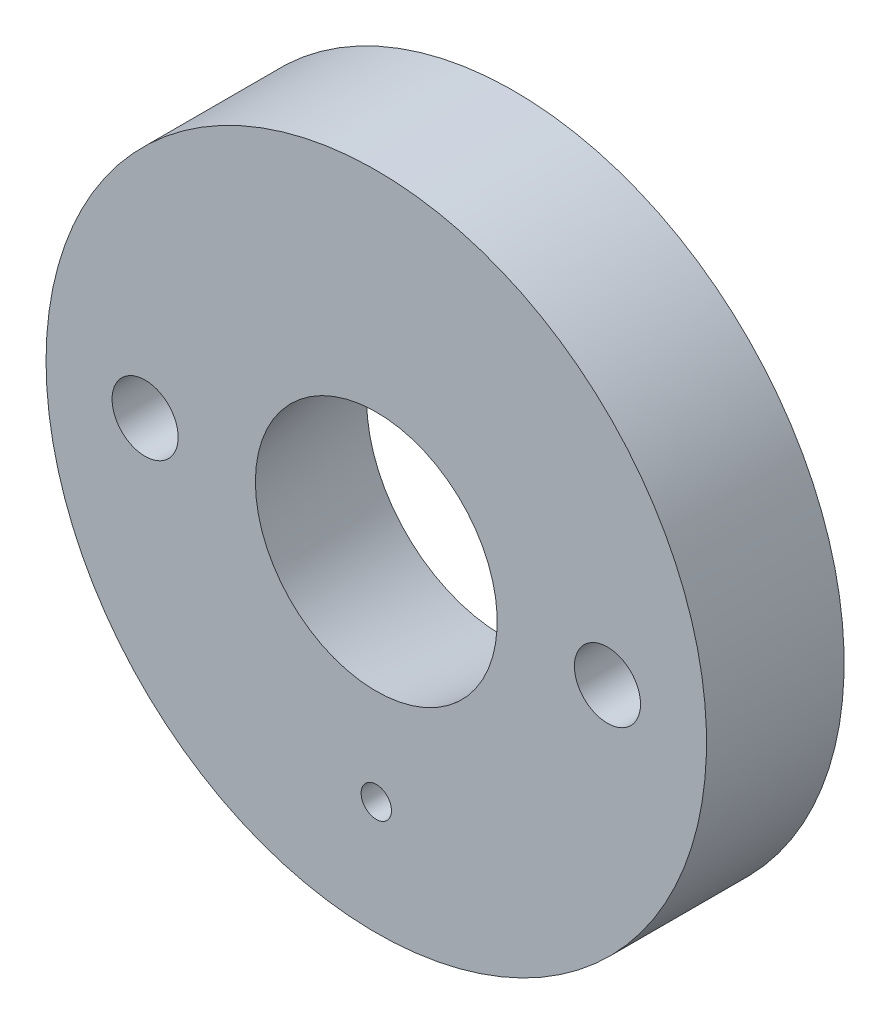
ISO-10303-21;
HEADER;
FILE_DESCRIPTION(('STEP AP214'),'2;1');
FILE_NAME('part.step','',(''),(''),'','','');
FILE_SCHEMA(('AUTOMOTIVE_DESIGN { 1 0 10303 214 1 1 1 1 }'));
ENDSEC;
DATA;
#1=APPLICATION_CONTEXT('core data for automotive mechanical design processes');
#2=APPLICATION_PROTOCOL_DEFINITION('international standard','automotive_design',2000,#1);
#3=PRODUCT_CONTEXT('',#1,'mechanical');
#4=PRODUCT('Part','Part','',(#3));
#5=PRODUCT_RELATED_PRODUCT_CATEGORY('part','',(#4));
#6=PRODUCT_DEFINITION_FORMATION('','',#4);
#7=PRODUCT_DEFINITION_CONTEXT('part definition',#1,'design');
#8=PRODUCT_DEFINITION('design','',#6,#7);
#9=PRODUCT_DEFINITION_SHAPE('','',#8);
#10=(LENGTH_UNIT() NAMED_UNIT(*) SI_UNIT(.MILLI.,.METRE.));
#11=(NAMED_UNIT(*) PLANE_ANGLE_UNIT() SI_UNIT($,.RADIAN.));
#12=(NAMED_UNIT(*) SI_UNIT($,.STERADIAN.) SOLID_ANGLE_UNIT());
#13=UNCERTAINTY_MEASURE_WITH_UNIT(LENGTH_MEASURE(1.E-05),#10,'distance_accuracy_value','');
#14=(GEOMETRIC_REPRESENTATION_CONTEXT(3) GLOBAL_UNCERTAINTY_ASSIGNED_CONTEXT((#13)) GLOBAL_UNIT_ASSIGNED_CONTEXT((#10,
#11,#12)) REPRESENTATION_CONTEXT('',''));
#15=CARTESIAN_POINT('',(0.,0.,0.));
#16=DIRECTION('',(0.,0.,1.));
#17=DIRECTION('',(1.,0.,0.));
#18=AXIS2_PLACEMENT_3D('',#15,#16,#17);
#19=CARTESIAN_POINT('',(0.,0.,0.));
#20=DIRECTION('',(0.,0.,-1.));
#21=DIRECTION('',(-1.,0.,0.));
#22=AXIS2_PLACEMENT_3D('',#19,#20,#21);
#23=CONICAL_SURFACE('',#22,5.58,0.120670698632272);
#24=CARTESIAN_POINT('',(0.,0.,0.));
#25=DIRECTION('',(0.,0.,-1.));
#26=DIRECTION('',(-1.,0.,0.));
#27=AXIS2_PLACEMENT_3D('',#24,#25,#26);
#28=CIRCLE('',#27,5.58);
#29=CARTESIAN_POINT('',(-5.58,0.,0.));
#30=VERTEX_POINT('',#29);
#31=EDGE_CURVE('E47',#30,#30,#28,.T.);
#32=ORIENTED_EDGE('',*,*,#31,.F.);
#33=EDGE_LOOP('',(#32));
#34=FACE_BOUND('',#33,.T.);
#35=CARTESIAN_POINT('',(0.,0.,-5.842));
#36=DIRECTION('',(0.,0.,-1.));
#37=DIRECTION('',(-1.,0.,0.));
#38=AXIS2_PLACEMENT_3D('',#35,#36,#37);
#39=CIRCLE('',#38,6.2884);
#40=CARTESIAN_POINT('',(-6.2884,0.,-5.842));
#41=VERTEX_POINT('',#40);
#42=EDGE_CURVE('E39',#41,#41,#39,.T.);
#43=ORIENTED_EDGE('',*,*,#42,.T.);
#44=EDGE_LOOP('',(#43));
#45=FACE_BOUND('',#44,.T.);
#46=ADVANCED_FACE('F35',(#34,#45),#23,.F.);
#47=CARTESIAN_POINT('',(-15.24,0.,0.));
#48=DIRECTION('',(0.,0.,1.));
#49=DIRECTION('',(1.,0.,0.));
#50=AXIS2_PLACEMENT_3D('',#47,#48,#49);
#51=PLANE('',#50);
#52=CARTESIAN_POINT('',(0.,-10.,0.));
#53=DIRECTION('',(0.,0.,1.));
#54=DIRECTION('',(1.,0.,0.));
#55=AXIS2_PLACEMENT_3D('',#52,#53,#54);
#56=CIRCLE('',#55,0.7);
#57=CARTESIAN_POINT('',(0.7,-10.,0.));
#58=VERTEX_POINT('',#57);
#59=EDGE_CURVE('E71',#58,#58,#56,.T.);
#60=ORIENTED_EDGE('',*,*,#59,.F.);
#61=EDGE_LOOP('',(#60));
#62=FACE_BOUND('',#61,.T.);
#63=CARTESIAN_POINT('',(-10.668,0.,0.));
#64=DIRECTION('',(0.,0.,1.));
#65=DIRECTION('',(1.,0.,0.));
#66=AXIS2_PLACEMENT_3D('',#63,#64,#65);
#67=CIRCLE('',#66,1.525);
#68=CARTESIAN_POINT('',(-9.143,0.,0.));
#69=VERTEX_POINT('',#68);
#70=EDGE_CURVE('E52',#69,#69,#67,.T.);
#71=ORIENTED_EDGE('',*,*,#70,.F.);
#72=EDGE_LOOP('',(#71));
#73=FACE_BOUND('',#72,.T.);
#74=CARTESIAN_POINT('',(10.668,0.,0.));
#75=DIRECTION('',(0.,0.,1.));
#76=DIRECTION('',(1.,0.,0.));
#77=AXIS2_PLACEMENT_3D('',#74,#75,#76);
#78=CIRCLE('',#77,1.525);
#79=CARTESIAN_POINT('',(12.193,0.,0.));
#80=VERTEX_POINT('',#79);
#81=EDGE_CURVE('E55',#80,#80,#78,.T.);
#82=ORIENTED_EDGE('',*,*,#81,.F.);
#83=EDGE_LOOP('',(#82));
#84=FACE_BOUND('',#83,.T.);
#85=ORIENTED_EDGE('',*,*,#31,.T.);
#86=EDGE_LOOP('',(#85));
#87=FACE_BOUND('',#86,.T.);
#88=CARTESIAN_POINT('',(0.,0.,0.));
#89=DIRECTION('',(0.,0.,-1.));
#90=DIRECTION('',(-1.,0.,0.));
#91=AXIS2_PLACEMENT_3D('',#88,#89,#90);
#92=CIRCLE('',#91,15.24);
#93=CARTESIAN_POINT('',(-15.24,0.,0.));
#94=VERTEX_POINT('',#93);
#95=EDGE_CURVE('E10',#94,#94,#92,.T.);
#96=ORIENTED_EDGE('',*,*,#95,.F.);
#97=EDGE_LOOP('',(#96));
#98=FACE_BOUND('',#97,.T.);
#99=ADVANCED_FACE('F37',(#62,#73,#84,#87,#98),#51,.T.);
#100=CARTESIAN_POINT('',(0.,0.,-11.3709302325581));
#101=DIRECTION('',(0.,0.,-1.));
#102=DIRECTION('',(-1.,0.,0.));
#103=AXIS2_PLACEMENT_3D('',#100,#101,#102);
#104=CYLINDRICAL_SURFACE('',#103,15.24);
#105=ORIENTED_EDGE('',*,*,#95,.T.);
#106=EDGE_LOOP('',(#105));
#107=FACE_BOUND('',#106,.T.);
#108=CARTESIAN_POINT('',(0.,0.,-6.35));
#109=DIRECTION('',(0.,0.,-1.));
#110=DIRECTION('',(-1.,0.,0.));
#111=AXIS2_PLACEMENT_3D('',#108,#109,#110);
#112=CIRCLE('',#111,15.24);
#113=CARTESIAN_POINT('',(-15.24,0.,-6.35));
#114=VERTEX_POINT('',#113);
#115=EDGE_CURVE('E43',#114,#114,#112,.T.);
#116=ORIENTED_EDGE('',*,*,#115,.F.);
#117=EDGE_LOOP('',(#116));
#118=FACE_BOUND('',#117,.T.);
#119=ADVANCED_FACE('F89',(#107,#118),#104,.T.);
#120=CARTESIAN_POINT('',(-6.35,0.,-6.35));
#121=DIRECTION('',(0.,0.,-1.));
#122=DIRECTION('',(-1.,0.,0.));
#123=AXIS2_PLACEMENT_3D('',#120,#121,#122);
#124=PLANE('',#123);
#125=CARTESIAN_POINT('',(0.,-10.,-6.35));
#126=DIRECTION('',(0.,0.,1.));
#127=DIRECTION('',(1.,0.,0.));
#128=AXIS2_PLACEMENT_3D('',#125,#126,#127);
#129=CIRCLE('',#128,0.7);
#130=CARTESIAN_POINT('',(0.7,-10.,-6.35));
#131=VERTEX_POINT('',#130);
#132=EDGE_CURVE('E68',#131,#131,#129,.T.);
#133=ORIENTED_EDGE('',*,*,#132,.T.);
#134=EDGE_LOOP('',(#133));
#135=FACE_BOUND('',#134,.T.);
#136=CARTESIAN_POINT('',(0.,0.,-6.35));
#137=DIRECTION('',(0.,0.,-1.));
#138=DIRECTION('',(-1.,0.,0.));
#139=AXIS2_PLACEMENT_3D('',#136,#137,#138);
#140=CIRCLE('',#139,7.62);
#141=CARTESIAN_POINT('',(-7.62,0.,-6.35));
#142=VERTEX_POINT('',#141);
#143=EDGE_CURVE('E64',#142,#142,#140,.T.);
#144=ORIENTED_EDGE('',*,*,#143,.F.);
#145=EDGE_LOOP('',(#144));
#146=FACE_BOUND('',#145,.T.);
#147=CARTESIAN_POINT('',(-10.668,0.,-6.35));
#148=DIRECTION('',(0.,0.,-1.));
#149=DIRECTION('',(-1.,0.,0.));
#150=AXIS2_PLACEMENT_3D('',#147,#148,#149);
#151=CIRCLE('',#150,1.525);
#152=CARTESIAN_POINT('',(-12.193,0.,-6.35));
#153=VERTEX_POINT('',#152);
#154=EDGE_CURVE('E58',#153,#153,#151,.T.);
#155=ORIENTED_EDGE('',*,*,#154,.F.);
#156=EDGE_LOOP('',(#155));
#157=FACE_BOUND('',#156,.T.);
#158=CARTESIAN_POINT('',(10.668,0.,-6.35));
#159=DIRECTION('',(0.,0.,-1.));
#160=DIRECTION('',(-1.,0.,0.));
#161=AXIS2_PLACEMENT_3D('',#158,#159,#160);
#162=CIRCLE('',#161,1.525);
#163=CARTESIAN_POINT('',(9.143,0.,-6.35));
#164=VERTEX_POINT('',#163);
#165=EDGE_CURVE('E59',#164,#164,#162,.T.);
#166=ORIENTED_EDGE('',*,*,#165,.F.);
#167=EDGE_LOOP('',(#166));
#168=FACE_BOUND('',#167,.T.);
#169=ORIENTED_EDGE('',*,*,#115,.T.);
#170=EDGE_LOOP('',(#169));
#171=FACE_BOUND('',#170,.T.);
#172=ADVANCED_FACE('F77',(#135,#146,#157,#168,#171),#124,.T.);
#173=CARTESIAN_POINT('',(10.668,0.,3.65));
#174=DIRECTION('',(0.,0.,-1.));
#175=DIRECTION('',(-1.,0.,0.));
#176=AXIS2_PLACEMENT_3D('',#173,#174,#175);
#177=CYLINDRICAL_SURFACE('',#176,1.525);
#178=ORIENTED_EDGE('',*,*,#81,.T.);
#179=EDGE_LOOP('',(#178));
#180=FACE_BOUND('',#179,.T.);
#181=ORIENTED_EDGE('',*,*,#165,.T.);
#182=EDGE_LOOP('',(#181));
#183=FACE_BOUND('',#182,.T.);
#184=ADVANCED_FACE('F116',(#180,#183),#177,.F.);
#185=CARTESIAN_POINT('',(-10.668,0.,3.65));
#186=DIRECTION('',(0.,0.,-1.));
#187=DIRECTION('',(-1.,0.,0.));
#188=AXIS2_PLACEMENT_3D('',#185,#186,#187);
#189=CYLINDRICAL_SURFACE('',#188,1.525);
#190=ORIENTED_EDGE('',*,*,#70,.T.);
#191=EDGE_LOOP('',(#190));
#192=FACE_BOUND('',#191,.T.);
#193=ORIENTED_EDGE('',*,*,#154,.T.);
#194=EDGE_LOOP('',(#193));
#195=FACE_BOUND('',#194,.T.);
#196=ADVANCED_FACE('F111',(#192,#195),#189,.F.);
#197=CARTESIAN_POINT('',(0.,0.,-5.842));
#198=DIRECTION('',(0.,0.,-1.));
#199=DIRECTION('',(-1.,0.,0.));
#200=AXIS2_PLACEMENT_3D('',#197,#198,#199);
#201=CYLINDRICAL_SURFACE('',#200,7.62);
#202=CARTESIAN_POINT('',(0.,0.,-5.842));
#203=DIRECTION('',(0.,0.,-1.));
#204=DIRECTION('',(-1.,0.,0.));
#205=AXIS2_PLACEMENT_3D('',#202,#203,#204);
#206=CIRCLE('',#205,7.62);
#207=CARTESIAN_POINT('',(-7.62,0.,-5.842));
#208=VERTEX_POINT('',#207);
#209=EDGE_CURVE('E67',#208,#208,#206,.T.);
#210=ORIENTED_EDGE('',*,*,#209,.F.);
#211=EDGE_LOOP('',(#210));
#212=FACE_BOUND('',#211,.T.);
#213=ORIENTED_EDGE('',*,*,#143,.T.);
#214=EDGE_LOOP('',(#213));
#215=FACE_BOUND('',#214,.T.);
#216=ADVANCED_FACE('F105',(#212,#215),#201,.F.);
#217=CARTESIAN_POINT('',(0.,0.,-5.842));
#218=DIRECTION('',(0.,0.,-1.));
#219=DIRECTION('',(-1.,0.,0.));
#220=AXIS2_PLACEMENT_3D('',#217,#218,#219);
#221=PLANE('',#220);
#222=ORIENTED_EDGE('',*,*,#42,.F.);
#223=EDGE_LOOP('',(#222));
#224=FACE_BOUND('',#223,.T.);
#225=ORIENTED_EDGE('',*,*,#209,.T.);
#226=EDGE_LOOP('',(#225));
#227=FACE_BOUND('',#226,.T.);
#228=ADVANCED_FACE('F83',(#224,#227),#221,.T.);
#229=CARTESIAN_POINT('',(0.,-10.,-6.35));
#230=DIRECTION('',(0.,0.,1.));
#231=DIRECTION('',(1.,0.,0.));
#232=AXIS2_PLACEMENT_3D('',#229,#230,#231);
#233=CYLINDRICAL_SURFACE('',#232,0.7);
#234=ORIENTED_EDGE('',*,*,#132,.F.);
#235=EDGE_LOOP('',(#234));
#236=FACE_BOUND('',#235,.T.);
#237=ORIENTED_EDGE('',*,*,#59,.T.);
#238=EDGE_LOOP('',(#237));
#239=FACE_BOUND('',#238,.T.);
#240=ADVANCED_FACE('F80',(#236,#239),#233,.F.);
#241=CLOSED_SHELL('',(#46,#99,#119,#172,#184,#196,#216,#228,#240));
#242=MANIFOLD_SOLID_BREP('B2',#241);
#243=ADVANCED_BREP_SHAPE_REPRESENTATION('',(#18,#242),#14);
#244=SHAPE_DEFINITION_REPRESENTATION(#9,#243);
ENDSEC;
END-ISO-10303-21;
